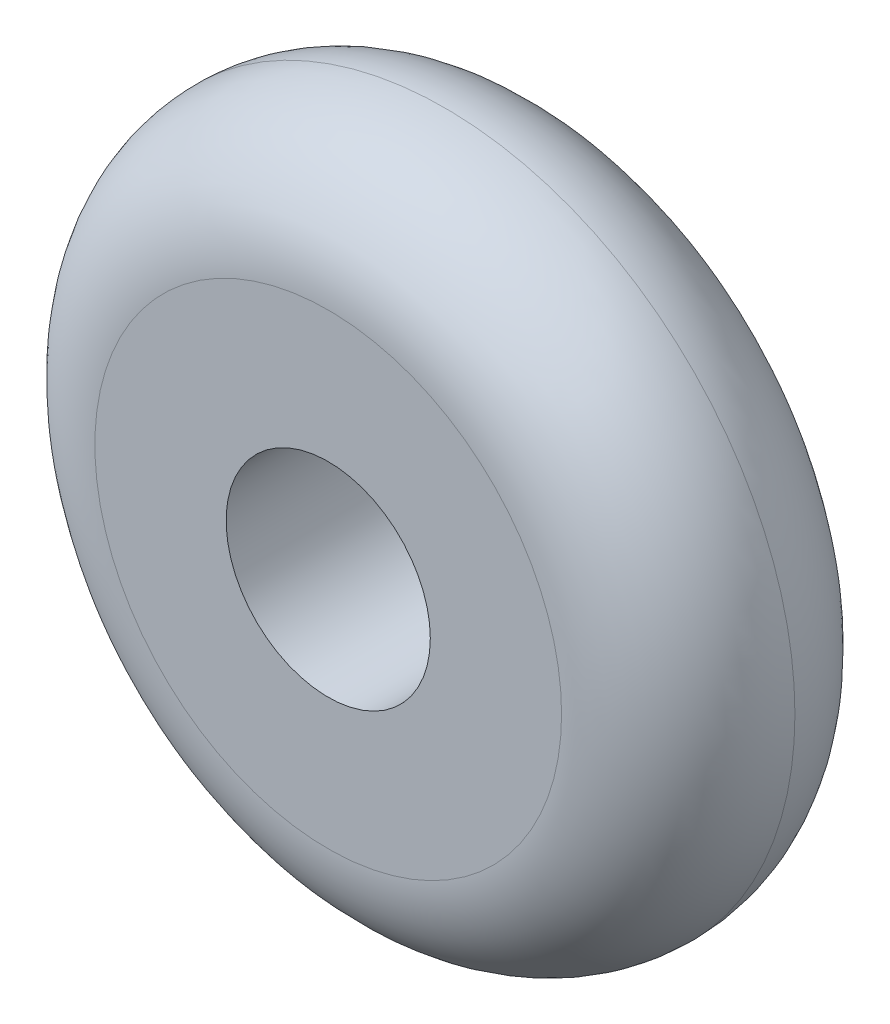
ISO-10303-21;
HEADER;
FILE_DESCRIPTION(('STEP AP214'),'2;1');
FILE_NAME('part.step','',(''),(''),'','','');
FILE_SCHEMA(('AUTOMOTIVE_DESIGN { 1 0 10303 214 1 1 1 1 }'));
ENDSEC;
DATA;
#1=APPLICATION_CONTEXT('core data for automotive mechanical design processes');
#2=APPLICATION_PROTOCOL_DEFINITION('international standard','automotive_design',2000,#1);
#3=PRODUCT_CONTEXT('',#1,'mechanical');
#4=PRODUCT('Part','Part','',(#3));
#5=PRODUCT_RELATED_PRODUCT_CATEGORY('part','',(#4));
#6=PRODUCT_DEFINITION_FORMATION('','',#4);
#7=PRODUCT_DEFINITION_CONTEXT('part definition',#1,'design');
#8=PRODUCT_DEFINITION('design','',#6,#7);
#9=PRODUCT_DEFINITION_SHAPE('','',#8);
#10=(LENGTH_UNIT() NAMED_UNIT(*) SI_UNIT(.MILLI.,.METRE.));
#11=(NAMED_UNIT(*) PLANE_ANGLE_UNIT() SI_UNIT($,.RADIAN.));
#12=(NAMED_UNIT(*) SI_UNIT($,.STERADIAN.) SOLID_ANGLE_UNIT());
#13=UNCERTAINTY_MEASURE_WITH_UNIT(LENGTH_MEASURE(1.E-05),#10,'distance_accuracy_value','');
#14=(GEOMETRIC_REPRESENTATION_CONTEXT(3) GLOBAL_UNCERTAINTY_ASSIGNED_CONTEXT((#13)) GLOBAL_UNIT_ASSIGNED_CONTEXT((#10,
#11,#12)) REPRESENTATION_CONTEXT('',''));
#15=CARTESIAN_POINT('',(0.,0.,0.));
#16=DIRECTION('',(0.,0.,1.));
#17=DIRECTION('',(1.,0.,0.));
#18=AXIS2_PLACEMENT_3D('',#15,#16,#17);
#19=CARTESIAN_POINT('',(0.,0.,25.4));
#20=DIRECTION('',(0.,0.,1.));
#21=DIRECTION('',(1.,0.,0.));
#22=AXIS2_PLACEMENT_3D('',#19,#20,#21);
#23=PLANE('',#22);
#24=CARTESIAN_POINT('',(0.,0.,25.4));
#25=DIRECTION('',(0.,0.,1.));
#26=DIRECTION('',(1.,0.,0.));
#27=AXIS2_PLACEMENT_3D('',#24,#25,#26);
#28=CIRCLE('',#27,25.4);
#29=CARTESIAN_POINT('',(25.4,0.,25.4));
#30=VERTEX_POINT('',#29);
#31=EDGE_CURVE('E10',#30,#30,#28,.T.);
#32=ORIENTED_EDGE('',*,*,#31,.T.);
#33=EDGE_LOOP('',(#32));
#34=FACE_BOUND('',#33,.T.);
#35=CARTESIAN_POINT('',(0.,0.,25.4));
#36=DIRECTION('',(0.,0.,1.));
#37=DIRECTION('',(1.,0.,0.));
#38=AXIS2_PLACEMENT_3D('',#35,#36,#37);
#39=CIRCLE('',#38,11.1125);
#40=CARTESIAN_POINT('',(11.1125,0.,25.4));
#41=VERTEX_POINT('',#40);
#42=EDGE_CURVE('E41',#41,#41,#39,.T.);
#43=ORIENTED_EDGE('',*,*,#42,.F.);
#44=EDGE_LOOP('',(#43));
#45=FACE_BOUND('',#44,.T.);
#46=ADVANCED_FACE('F29',(#34,#45),#23,.T.);
#47=CARTESIAN_POINT('',(0.,0.,0.));
#48=DIRECTION('',(0.,0.,1.));
#49=DIRECTION('',(1.,0.,0.));
#50=AXIS2_PLACEMENT_3D('',#47,#48,#49);
#51=PLANE('',#50);
#52=CARTESIAN_POINT('',(0.,0.,0.));
#53=DIRECTION('',(0.,0.,1.));
#54=DIRECTION('',(1.,0.,0.));
#55=AXIS2_PLACEMENT_3D('',#52,#53,#54);
#56=CIRCLE('',#55,25.4);
#57=CARTESIAN_POINT('',(25.4,0.,0.));
#58=VERTEX_POINT('',#57);
#59=EDGE_CURVE('E37',#58,#58,#56,.F.);
#60=ORIENTED_EDGE('',*,*,#59,.T.);
#61=EDGE_LOOP('',(#60));
#62=FACE_BOUND('',#61,.T.);
#63=CARTESIAN_POINT('',(0.,0.,0.));
#64=DIRECTION('',(0.,0.,1.));
#65=DIRECTION('',(1.,0.,0.));
#66=AXIS2_PLACEMENT_3D('',#63,#64,#65);
#67=CIRCLE('',#66,11.1125);
#68=CARTESIAN_POINT('',(11.1125,0.,0.));
#69=VERTEX_POINT('',#68);
#70=EDGE_CURVE('E44',#69,#69,#67,.T.);
#71=ORIENTED_EDGE('',*,*,#70,.T.);
#72=EDGE_LOOP('',(#71));
#73=FACE_BOUND('',#72,.T.);
#74=ADVANCED_FACE('F54',(#62,#73),#51,.F.);
#75=CARTESIAN_POINT('',(0.,0.,25.4));
#76=DIRECTION('',(0.,0.,-1.));
#77=DIRECTION('',(-1.,0.,0.));
#78=AXIS2_PLACEMENT_3D('',#75,#76,#77);
#79=CYLINDRICAL_SURFACE('',#78,11.1125);
#80=ORIENTED_EDGE('',*,*,#42,.T.);
#81=EDGE_LOOP('',(#80));
#82=FACE_BOUND('',#81,.T.);
#83=ORIENTED_EDGE('',*,*,#70,.F.);
#84=EDGE_LOOP('',(#83));
#85=FACE_BOUND('',#84,.T.);
#86=ADVANCED_FACE('F50',(#82,#85),#79,.F.);
#87=CARTESIAN_POINT('',(0.,0.,12.7));
#88=DIRECTION('',(0.,0.,1.));
#89=DIRECTION('',(1.,0.,0.));
#90=AXIS2_PLACEMENT_3D('',#87,#88,#89);
#91=TOROIDAL_SURFACE('',#90,25.4,12.7);
#92=ORIENTED_EDGE('',*,*,#31,.F.);
#93=EDGE_LOOP('',(#92));
#94=FACE_BOUND('',#93,.T.);
#95=CARTESIAN_POINT('',(0.,0.,12.7));
#96=DIRECTION('',(0.,0.,1.));
#97=DIRECTION('',(1.,0.,0.));
#98=AXIS2_PLACEMENT_3D('',#95,#96,#97);
#99=CIRCLE('',#98,38.1);
#100=CARTESIAN_POINT('',(38.1,0.,12.7));
#101=VERTEX_POINT('',#100);
#102=EDGE_CURVE('E33',#101,#101,#99,.F.);
#103=ORIENTED_EDGE('',*,*,#102,.F.);
#104=EDGE_LOOP('',(#103));
#105=FACE_BOUND('',#104,.T.);
#106=ADVANCED_FACE('F31',(#94,#105),#91,.T.);
#107=CARTESIAN_POINT('',(0.,0.,12.7));
#108=DIRECTION('',(0.,0.,1.));
#109=DIRECTION('',(1.,0.,0.));
#110=AXIS2_PLACEMENT_3D('',#107,#108,#109);
#111=TOROIDAL_SURFACE('',#110,25.4,12.7);
#112=ORIENTED_EDGE('',*,*,#59,.F.);
#113=EDGE_LOOP('',(#112));
#114=FACE_BOUND('',#113,.T.);
#115=ORIENTED_EDGE('',*,*,#102,.T.);
#116=EDGE_LOOP('',(#115));
#117=FACE_BOUND('',#116,.T.);
#118=ADVANCED_FACE('F62',(#114,#117),#111,.T.);
#119=CLOSED_SHELL('',(#46,#74,#86,#106,#118));
#120=MANIFOLD_SOLID_BREP('B2',#119);
#121=ADVANCED_BREP_SHAPE_REPRESENTATION('',(#18,#120),#14);
#122=SHAPE_DEFINITION_REPRESENTATION(#9,#121);
ENDSEC;
END-ISO-10303-21;
